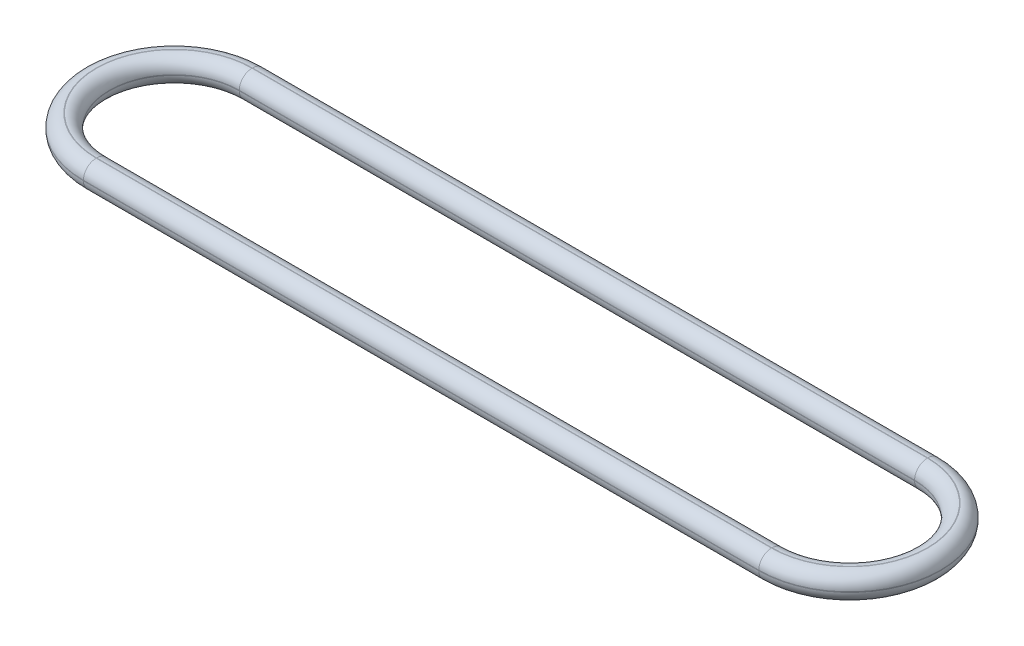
from build123d import *

# Parameters (mm, degrees)
BOSS_EXTRUDE1_DEPTH = 1
FILLET1_R           = 0.49


with BuildPart() as part:
    # Sketch1 → Boss-Extrude1 (new body)
    with BuildSketch(Plane(origin=(0, 0, 0), x_dir=(1, 0, 0), z_dir=(0, 1, 0))):
        with BuildLine():
            Line((0, 3.5), (26, 3.5))
            ThreePointArc((26, 3.5), (29.5, 0), (26, -3.5))
            Line((26, -3.5), (0, -3.5))
            ThreePointArc((0, -3.5), (-3.5, 0), (0, 3.5))
        make_face()
        with BuildLine():
            Line((0, 2.5), (26, 2.5))
            ThreePointArc((26, 2.5), (28.5, 0), (26, -2.5))
            Line((26, -2.5), (0, -2.5))
            ThreePointArc((0, -2.5), (-2.5, 0), (0, 2.5))
        make_face(mode=Mode.SUBTRACT)
    extrude(amount=BOSS_EXTRUDE1_DEPTH)

    # Fillet1
    fillet1_edges = [part.edges().sort_by_distance(p)[0] for p in [
        (29.5, 1, 0),
        (13, 1, -3.5),
        (-2.5, 0, 0),
        (13, 0, 2.5),
        (28.5, 0, 0),
        (13, 0, -2.5),
        (-2.5, 1, 0),
        (13, 1, 2.5),
        (28.5, 1, 0),
        (13, 1, -2.5),
        (-3.5, 1, 0),
        (13, 0, -3.5),
        (29.5, 0, 0),
        (13, 0, 3.5),
        (-3.5, 0, 0),
        (13, 1, 3.5),
    ]]
    fillet(fillet1_edges, radius=FILLET1_R)


solid = part.part
